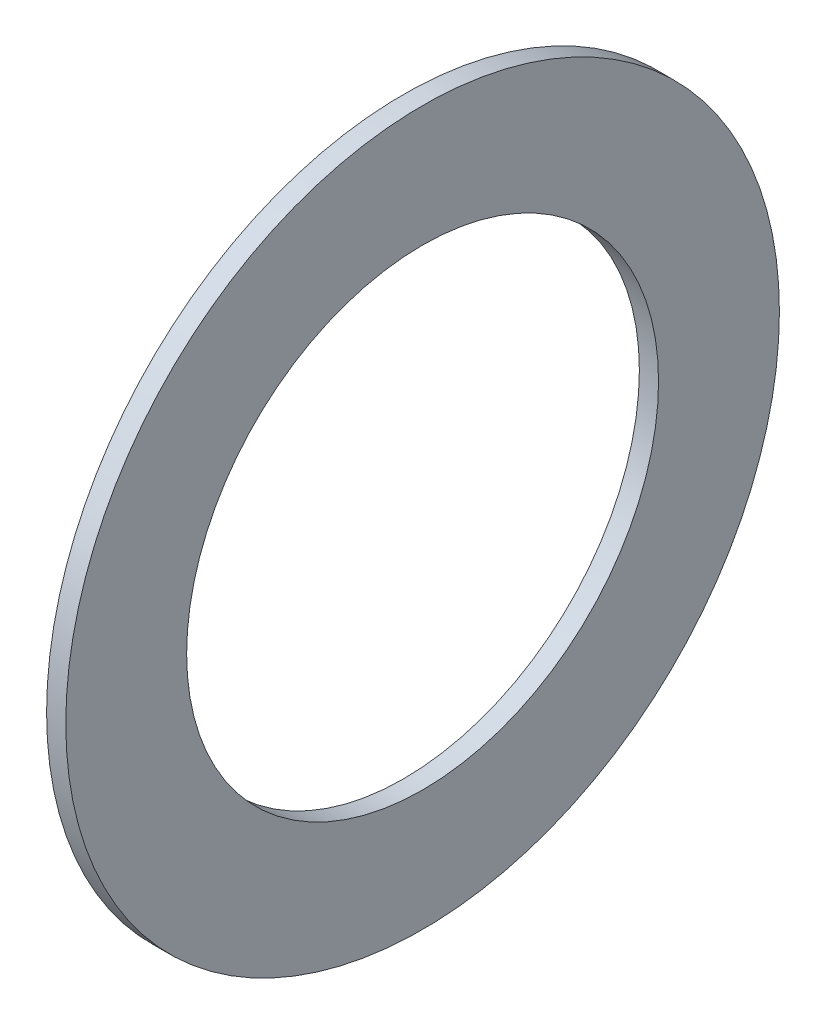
ISO-10303-21;
HEADER;
FILE_DESCRIPTION(('STEP AP214'),'2;1');
FILE_NAME('part.step','',(''),(''),'','','');
FILE_SCHEMA(('AUTOMOTIVE_DESIGN { 1 0 10303 214 1 1 1 1 }'));
ENDSEC;
DATA;
#1=APPLICATION_CONTEXT('core data for automotive mechanical design processes');
#2=APPLICATION_PROTOCOL_DEFINITION('international standard','automotive_design',2000,#1);
#3=PRODUCT_CONTEXT('',#1,'mechanical');
#4=PRODUCT('Part','Part','',(#3));
#5=PRODUCT_RELATED_PRODUCT_CATEGORY('part','',(#4));
#6=PRODUCT_DEFINITION_FORMATION('','',#4);
#7=PRODUCT_DEFINITION_CONTEXT('part definition',#1,'design');
#8=PRODUCT_DEFINITION('design','',#6,#7);
#9=PRODUCT_DEFINITION_SHAPE('','',#8);
#10=(LENGTH_UNIT() NAMED_UNIT(*) SI_UNIT(.MILLI.,.METRE.));
#11=(NAMED_UNIT(*) PLANE_ANGLE_UNIT() SI_UNIT($,.RADIAN.));
#12=(NAMED_UNIT(*) SI_UNIT($,.STERADIAN.) SOLID_ANGLE_UNIT());
#13=UNCERTAINTY_MEASURE_WITH_UNIT(LENGTH_MEASURE(1.E-05),#10,'distance_accuracy_value','');
#14=(GEOMETRIC_REPRESENTATION_CONTEXT(3) GLOBAL_UNCERTAINTY_ASSIGNED_CONTEXT((#13)) GLOBAL_UNIT_ASSIGNED_CONTEXT((#10,
#11,#12)) REPRESENTATION_CONTEXT('',''));
#15=CARTESIAN_POINT('',(0.,0.,0.));
#16=DIRECTION('',(0.,0.,1.));
#17=DIRECTION('',(1.,0.,0.));
#18=AXIS2_PLACEMENT_3D('',#15,#16,#17);
#19=CARTESIAN_POINT('',(-0.999999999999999,18.6,0.));
#20=DIRECTION('',(1.,0.,0.));
#21=DIRECTION('',(0.,0.,-1.));
#22=AXIS2_PLACEMENT_3D('',#19,#20,#21);
#23=PLANE('',#22);
#24=CARTESIAN_POINT('',(-0.999999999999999,0.,0.));
#25=DIRECTION('',(-1.,0.,0.));
#26=DIRECTION('',(0.,0.,1.));
#27=AXIS2_PLACEMENT_3D('',#24,#25,#26);
#28=CIRCLE('',#27,12.3);
#29=CARTESIAN_POINT('',(-0.999999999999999,0.,12.3));
#30=VERTEX_POINT('',#29);
#31=EDGE_CURVE('E10',#30,#30,#28,.T.);
#32=ORIENTED_EDGE('',*,*,#31,.F.);
#33=EDGE_LOOP('',(#32));
#34=FACE_BOUND('',#33,.T.);
#35=CARTESIAN_POINT('',(-0.999999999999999,0.,0.));
#36=DIRECTION('',(-1.,0.,0.));
#37=DIRECTION('',(0.,0.,1.));
#38=AXIS2_PLACEMENT_3D('',#35,#36,#37);
#39=CIRCLE('',#38,18.6);
#40=CARTESIAN_POINT('',(-0.999999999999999,0.,18.6));
#41=VERTEX_POINT('',#40);
#42=EDGE_CURVE('E40',#41,#41,#39,.T.);
#43=ORIENTED_EDGE('',*,*,#42,.T.);
#44=EDGE_LOOP('',(#43));
#45=FACE_BOUND('',#44,.T.);
#46=ADVANCED_FACE('F26',(#34,#45),#23,.F.);
#47=CARTESIAN_POINT('',(-10.6250704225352,0.,0.));
#48=DIRECTION('',(-1.,0.,0.));
#49=DIRECTION('',(0.,0.,1.));
#50=AXIS2_PLACEMENT_3D('',#47,#48,#49);
#51=CYLINDRICAL_SURFACE('',#50,12.3);
#52=CARTESIAN_POINT('',(0.,0.,0.));
#53=DIRECTION('',(-1.,0.,0.));
#54=DIRECTION('',(0.,0.,1.));
#55=AXIS2_PLACEMENT_3D('',#52,#53,#54);
#56=CIRCLE('',#55,12.3);
#57=CARTESIAN_POINT('',(0.,0.,12.3));
#58=VERTEX_POINT('',#57);
#59=EDGE_CURVE('E32',#58,#58,#56,.T.);
#60=ORIENTED_EDGE('',*,*,#59,.F.);
#61=EDGE_LOOP('',(#60));
#62=FACE_BOUND('',#61,.T.);
#63=ORIENTED_EDGE('',*,*,#31,.T.);
#64=EDGE_LOOP('',(#63));
#65=FACE_BOUND('',#64,.T.);
#66=ADVANCED_FACE('F55',(#62,#65),#51,.F.);
#67=CARTESIAN_POINT('',(0.,18.6,0.));
#68=DIRECTION('',(-1.,0.,0.));
#69=DIRECTION('',(0.,0.,1.));
#70=AXIS2_PLACEMENT_3D('',#67,#68,#69);
#71=PLANE('',#70);
#72=CARTESIAN_POINT('',(0.,0.,0.));
#73=DIRECTION('',(-1.,0.,0.));
#74=DIRECTION('',(0.,0.,1.));
#75=AXIS2_PLACEMENT_3D('',#72,#73,#74);
#76=CIRCLE('',#75,18.6);
#77=CARTESIAN_POINT('',(0.,0.,18.6));
#78=VERTEX_POINT('',#77);
#79=EDGE_CURVE('E36',#78,#78,#76,.T.);
#80=ORIENTED_EDGE('',*,*,#79,.F.);
#81=EDGE_LOOP('',(#80));
#82=FACE_BOUND('',#81,.T.);
#83=ORIENTED_EDGE('',*,*,#59,.T.);
#84=EDGE_LOOP('',(#83));
#85=FACE_BOUND('',#84,.T.);
#86=ADVANCED_FACE('F50',(#82,#85),#71,.F.);
#87=CARTESIAN_POINT('',(-10.6250704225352,0.,0.));
#88=DIRECTION('',(-1.,0.,0.));
#89=DIRECTION('',(0.,0.,1.));
#90=AXIS2_PLACEMENT_3D('',#87,#88,#89);
#91=CYLINDRICAL_SURFACE('',#90,18.6);
#92=ORIENTED_EDGE('',*,*,#42,.F.);
#93=EDGE_LOOP('',(#92));
#94=FACE_BOUND('',#93,.T.);
#95=ORIENTED_EDGE('',*,*,#79,.T.);
#96=EDGE_LOOP('',(#95));
#97=FACE_BOUND('',#96,.T.);
#98=ADVANCED_FACE('F47',(#94,#97),#91,.T.);
#99=CLOSED_SHELL('',(#46,#66,#86,#98));
#100=MANIFOLD_SOLID_BREP('B2',#99);
#101=ADVANCED_BREP_SHAPE_REPRESENTATION('',(#18,#100),#14);
#102=SHAPE_DEFINITION_REPRESENTATION(#9,#101);
ENDSEC;
END-ISO-10303-21;
